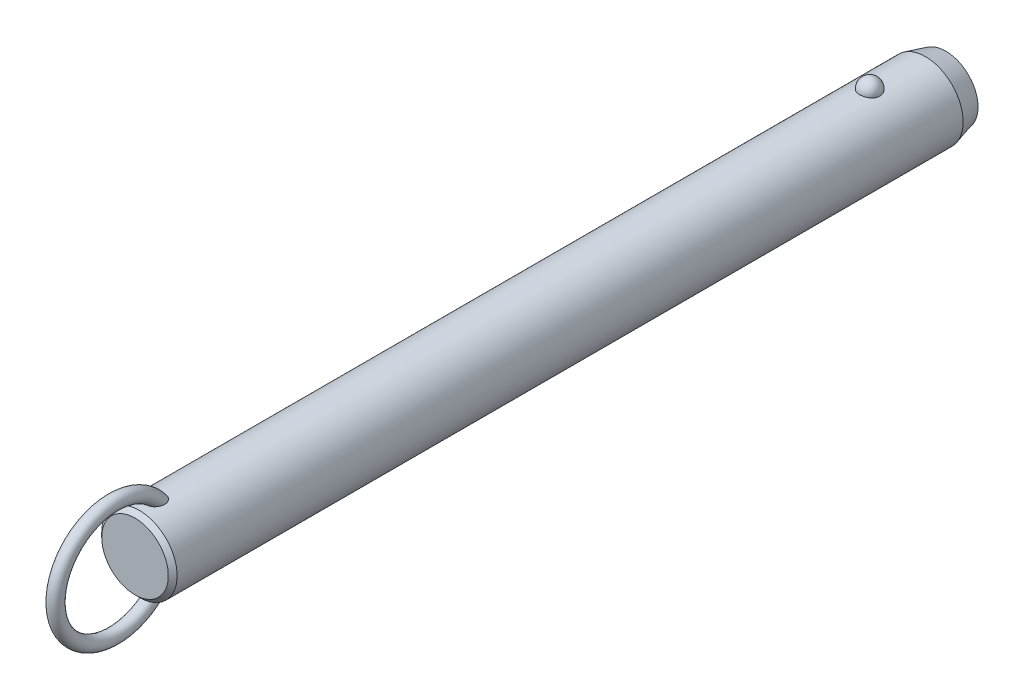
ISO-10303-21;
HEADER;
FILE_DESCRIPTION(('STEP AP214'),'2;1');
FILE_NAME('part.step','',(''),(''),'','','');
FILE_SCHEMA(('AUTOMOTIVE_DESIGN { 1 0 10303 214 1 1 1 1 }'));
ENDSEC;
DATA;
#1=APPLICATION_CONTEXT('core data for automotive mechanical design processes');
#2=APPLICATION_PROTOCOL_DEFINITION('international standard','automotive_design',2000,#1);
#3=PRODUCT_CONTEXT('',#1,'mechanical');
#4=PRODUCT('Part','Part','',(#3));
#5=PRODUCT_RELATED_PRODUCT_CATEGORY('part','',(#4));
#6=PRODUCT_DEFINITION_FORMATION('','',#4);
#7=PRODUCT_DEFINITION_CONTEXT('part definition',#1,'design');
#8=PRODUCT_DEFINITION('design','',#6,#7);
#9=PRODUCT_DEFINITION_SHAPE('','',#8);
#10=(LENGTH_UNIT() NAMED_UNIT(*) SI_UNIT(.MILLI.,.METRE.));
#11=(NAMED_UNIT(*) PLANE_ANGLE_UNIT() SI_UNIT($,.RADIAN.));
#12=(NAMED_UNIT(*) SI_UNIT($,.STERADIAN.) SOLID_ANGLE_UNIT());
#13=UNCERTAINTY_MEASURE_WITH_UNIT(LENGTH_MEASURE(1.E-05),#10,'distance_accuracy_value','');
#14=(GEOMETRIC_REPRESENTATION_CONTEXT(3) GLOBAL_UNCERTAINTY_ASSIGNED_CONTEXT((#13)) GLOBAL_UNIT_ASSIGNED_CONTEXT((#10,
#11,#12)) REPRESENTATION_CONTEXT('',''));
#15=CARTESIAN_POINT('',(0.,0.,0.));
#16=DIRECTION('',(0.,0.,1.));
#17=DIRECTION('',(1.,0.,0.));
#18=AXIS2_PLACEMENT_3D('',#15,#16,#17);
#19=CARTESIAN_POINT('',(0.,0.,200.6));
#20=DIRECTION('',(0.,0.,-1.));
#21=DIRECTION('',(-1.,0.,0.));
#22=AXIS2_PLACEMENT_3D('',#19,#20,#21);
#23=CYLINDRICAL_SURFACE('',#22,11.1);
#24=CARTESIAN_POINT('',(2.9724815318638,10.6945945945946,-3.00000000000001));
#25=CARTESIAN_POINT('',(2.97247830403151,10.6945972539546,-2.8322505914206));
#26=CARTESIAN_POINT('',(2.95876598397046,10.6984356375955,-2.66445972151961));
#27=CARTESIAN_POINT('',(2.90424529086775,10.7133624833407,-2.3336238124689));
#28=CARTESIAN_POINT('',(2.8634252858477,10.7244540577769,-2.17058084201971));
#29=CARTESIAN_POINT('',(2.75573657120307,10.7526272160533,-1.85396767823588));
#30=CARTESIAN_POINT('',(2.68887937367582,10.7697061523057,-1.70039333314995));
#31=CARTESIAN_POINT('',(2.53079696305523,10.8079438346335,-1.4069159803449));
#32=CARTESIAN_POINT('',(2.43957264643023,10.8291024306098,-1.26701246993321));
#33=CARTESIAN_POINT('',(2.23458150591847,10.8732541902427,-1.00409565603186));
#34=CARTESIAN_POINT('',(2.12071295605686,10.8962553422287,-0.881162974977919));
#35=CARTESIAN_POINT('',(1.87365402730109,10.9414421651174,-0.656352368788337));
#36=CARTESIAN_POINT('',(1.74046358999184,10.9636278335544,-0.554474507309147));
#37=CARTESIAN_POINT('',(1.45872188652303,11.0046495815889,-0.374872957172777));
#38=CARTESIAN_POINT('',(1.31021276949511,11.0234944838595,-0.297085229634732));
#39=CARTESIAN_POINT('',(1.00170030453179,11.0557957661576,-0.167529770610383));
#40=CARTESIAN_POINT('',(0.841698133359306,11.0692526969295,-0.1157593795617));
#41=CARTESIAN_POINT('',(0.517607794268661,11.0890932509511,-0.0403925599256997));
#42=CARTESIAN_POINT('',(0.353633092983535,11.0955916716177,-0.0163383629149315));
#43=CARTESIAN_POINT('',(0.0238420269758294,11.1011989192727,0.00445177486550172));
#44=CARTESIAN_POINT('',(-0.141974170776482,11.1003084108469,0.00119017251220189));
#45=CARTESIAN_POINT('',(-0.468405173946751,11.0912990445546,-0.0323233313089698));
#46=CARTESIAN_POINT('',(-0.629059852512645,11.0832767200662,-0.062214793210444));
#47=CARTESIAN_POINT('',(-0.942937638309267,11.0609962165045,-0.147645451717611));
#48=CARTESIAN_POINT('',(-1.09616062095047,11.0467379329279,-0.203185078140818));
#49=CARTESIAN_POINT('',(-1.39181061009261,11.0134071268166,-0.338752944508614));
#50=CARTESIAN_POINT('',(-1.53417383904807,10.9943086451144,-0.418913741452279));
#51=CARTESIAN_POINT('',(-1.80342160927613,10.9533667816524,-0.601448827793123));
#52=CARTESIAN_POINT('',(-1.9303046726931,10.9315231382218,-0.703825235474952));
#53=CARTESIAN_POINT('',(-2.16747598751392,10.887005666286,-0.930091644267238));
#54=CARTESIAN_POINT('',(-2.27742774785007,10.8643239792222,-1.05433291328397));
#55=CARTESIAN_POINT('',(-2.47517316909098,10.8209886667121,-1.31966633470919));
#56=CARTESIAN_POINT('',(-2.56296538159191,10.8003351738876,-1.46075958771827));
#57=CARTESIAN_POINT('',(-2.71500300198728,10.7631304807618,-1.75753646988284));
#58=CARTESIAN_POINT('',(-2.77898901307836,10.7466250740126,-1.91335887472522));
#59=CARTESIAN_POINT('',(-2.88046189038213,10.7198747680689,-2.23391529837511));
#60=CARTESIAN_POINT('',(-2.91794947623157,10.709629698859,-2.3986490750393));
#61=CARTESIAN_POINT('',(-2.96537819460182,10.6965949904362,-2.73165170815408));
#62=CARTESIAN_POINT('',(-2.97542891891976,10.693775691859,-2.89990378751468));
#63=CARTESIAN_POINT('',(-2.96804271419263,10.6958279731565,-3.23575286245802));
#64=CARTESIAN_POINT('',(-2.95060646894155,10.7006993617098,-3.4033498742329));
#65=CARTESIAN_POINT('',(-2.88883358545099,10.71753912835,-3.73233906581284));
#66=CARTESIAN_POINT('',(-2.84462026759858,10.7294749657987,-3.89375610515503));
#67=CARTESIAN_POINT('',(-2.73050447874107,10.7590797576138,-4.20667949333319));
#68=CARTESIAN_POINT('',(-2.66060103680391,10.7767489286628,-4.35818546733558));
#69=CARTESIAN_POINT('',(-2.49642559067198,10.8159599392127,-4.64785421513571));
#70=CARTESIAN_POINT('',(-2.40203047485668,10.8375211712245,-4.78594458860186));
#71=CARTESIAN_POINT('',(-2.19143488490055,10.8820570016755,-5.04410382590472));
#72=CARTESIAN_POINT('',(-2.07523364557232,10.9050316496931,-5.16417205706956));
#73=CARTESIAN_POINT('',(-1.82361254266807,10.9499219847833,-5.3833483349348));
#74=CARTESIAN_POINT('',(-1.68812945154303,10.9718338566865,-5.48238464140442));
#75=CARTESIAN_POINT('',(-1.40191298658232,11.0120611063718,-5.65618873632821));
#76=CARTESIAN_POINT('',(-1.25118062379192,11.0303767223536,-5.73095813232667));
#77=CARTESIAN_POINT('',(-0.940570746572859,11.0611653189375,-5.85334725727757));
#78=CARTESIAN_POINT('',(-0.780821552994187,11.0737044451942,-5.90127578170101));
#79=CARTESIAN_POINT('',(-0.455204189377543,11.0918598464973,-5.96992976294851));
#80=CARTESIAN_POINT('',(-0.289336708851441,11.0974768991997,-5.99065827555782));
#81=CARTESIAN_POINT('',(0.0406846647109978,11.1011307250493,-6.00418773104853));
#82=CARTESIAN_POINT('',(0.204817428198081,11.099299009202,-5.9974731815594));
#83=CARTESIAN_POINT('',(0.5295530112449,11.088551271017,-5.95740317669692));
#84=CARTESIAN_POINT('',(0.69015594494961,11.0796354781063,-5.92404858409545));
#85=CARTESIAN_POINT('',(1.0027760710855,11.0557204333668,-5.83180084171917));
#86=CARTESIAN_POINT('',(1.15482001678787,11.0407414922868,-5.7729929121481));
#87=CARTESIAN_POINT('',(1.44678373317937,11.0062913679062,-5.63147366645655));
#88=CARTESIAN_POINT('',(1.58670279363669,10.9868199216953,-5.54876095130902));
#89=CARTESIAN_POINT('',(1.8527023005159,10.9451315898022,-5.36027644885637));
#90=CARTESIAN_POINT('',(1.97855158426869,10.9228788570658,-5.25418644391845));
#91=CARTESIAN_POINT('',(2.21080872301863,10.8782509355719,-5.02251354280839));
#92=CARTESIAN_POINT('',(2.31721312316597,10.8558757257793,-4.89692718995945));
#93=CARTESIAN_POINT('',(2.5094551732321,10.8130715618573,-4.62745408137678));
#94=CARTESIAN_POINT('',(2.59493284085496,10.7926798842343,-4.48330448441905));
#95=CARTESIAN_POINT('',(2.740862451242,10.7565495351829,-4.18236358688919));
#96=CARTESIAN_POINT('',(2.80132490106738,10.7408089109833,-4.02557762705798));
#97=CARTESIAN_POINT('',(2.88959070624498,10.7173718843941,-3.72475308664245));
#98=CARTESIAN_POINT('',(2.92062102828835,10.7088950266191,-3.58171216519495));
#99=CARTESIAN_POINT('',(2.96206765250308,10.6975052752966,-3.29245795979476));
#100=CARTESIAN_POINT('',(2.97248434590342,10.6945922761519,-3.14624473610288));
#101=CARTESIAN_POINT('',(2.9724815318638,10.6945945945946,-3.00000000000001));
#102=B_SPLINE_CURVE_WITH_KNOTS('',3,(#24,#25,#26,#27,#28,#29,#30,#31,#32,#33,#34,#35,#36,#37,
#38,#39,#40,#41,#42,#43,#44,#45,#46,#47,#48,#49,#50,#51,#52,#53,#54,#55,#56,#57,#58,#59,#60,#61,
#62,#63,#64,#65,#66,#67,#68,#69,#70,#71,#72,#73,#74,#75,#76,#77,#78,#79,#80,#81,#82,#83,#84,#85,
#86,#87,#88,#89,#90,#91,#92,#93,#94,#95,#96,#97,#98,#99,#100,#101),.UNSPECIFIED.,.T.,.F.,(4,2,2,
2,2,2,2,2,2,2,2,2,2,2,2,2,2,2,2,2,2,2,2,2,2,2,2,2,2,2,2,2,2,2,2,2,2,2,4),(0.,0.502722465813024,
1.00566079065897,1.5083769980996,2.01107471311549,2.51608392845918,3.02109467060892,
3.52475118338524,4.02835620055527,4.523518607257,5.0186364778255,5.50715297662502,
5.9956776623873,6.48688002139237,6.97812923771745,7.47814366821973,7.9781907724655,
8.48353712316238,8.9888697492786,9.49218093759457,9.99547960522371,10.4964777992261,
10.997494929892,11.5010810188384,12.0046847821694,12.5099796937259,13.0152411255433,
13.5145635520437,14.0138298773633,14.5043200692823,14.9947943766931,15.4836390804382,
15.9725123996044,16.4685040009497,16.9645836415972,17.4686765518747,17.972557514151,
18.410841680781,18.849117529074),.UNSPECIFIED.);
#103=CARTESIAN_POINT('',(2.9724815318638,10.6945945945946,-3.00000000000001));
#104=VERTEX_POINT('',#103);
#105=EDGE_CURVE('E41',#104,#104,#102,.T.);
#106=ORIENTED_EDGE('',*,*,#105,.T.);
#107=EDGE_LOOP('',(#106));
#108=FACE_BOUND('',#107,.T.);
#109=CARTESIAN_POINT('',(0.,0.,212.));
#110=DIRECTION('',(0.,0.,1.));
#111=DIRECTION('',(1.,0.,0.));
#112=AXIS2_PLACEMENT_3D('',#109,#110,#111);
#113=CIRCLE('',#112,11.1);
#114=CARTESIAN_POINT('',(-11.1,0.,212.));
#115=VERTEX_POINT('',#114);
#116=EDGE_CURVE('E10',#115,#115,#113,.F.);
#117=ORIENTED_EDGE('',*,*,#116,.T.);
#118=EDGE_LOOP('',(#117));
#119=FACE_BOUND('',#118,.T.);
#120=CARTESIAN_POINT('',(-0.564520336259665,-11.0856356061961,204.257815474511));
#121=CARTESIAN_POINT('',(-0.667202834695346,-11.0804062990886,204.291283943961));
#122=CARTESIAN_POINT('',(-0.766875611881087,-11.0738877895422,204.333835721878));
#123=CARTESIAN_POINT('',(-0.95728412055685,-11.0590576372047,204.435419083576));
#124=CARTESIAN_POINT('',(-1.04801616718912,-11.0507452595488,204.49445742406));
#125=CARTESIAN_POINT('',(-1.21800952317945,-11.0333016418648,204.626529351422));
#126=CARTESIAN_POINT('',(-1.2973080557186,-11.0241732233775,204.699515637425));
#127=CARTESIAN_POINT('',(-1.44337665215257,-11.0060026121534,204.857037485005));
#128=CARTESIAN_POINT('',(-1.51014622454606,-10.9969604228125,204.941573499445));
#129=CARTESIAN_POINT('',(-1.63454620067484,-10.9791841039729,205.125521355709));
#130=CARTESIAN_POINT('',(-1.69127003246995,-10.9705107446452,205.225549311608));
#131=CARTESIAN_POINT('',(-1.7898078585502,-10.9548648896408,205.432790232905));
#132=CARTESIAN_POINT('',(-1.83161214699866,-10.9478935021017,205.540007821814));
#133=CARTESIAN_POINT('',(-1.91557028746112,-10.9335803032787,205.805408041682));
#134=CARTESIAN_POINT('',(-1.95040620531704,-10.9273269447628,205.965980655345));
#135=CARTESIAN_POINT('',(-1.99388326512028,-10.9194709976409,206.290697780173));
#136=CARTESIAN_POINT('',(-2.00248051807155,-10.9178762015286,206.454847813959));
#137=CARTESIAN_POINT('',(-1.99551615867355,-10.9191578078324,206.824650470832));
#138=CARTESIAN_POINT('',(-1.9732206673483,-10.9232807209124,207.030191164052));
#139=CARTESIAN_POINT('',(-1.9152976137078,-10.9335244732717,207.333595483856));
#140=CARTESIAN_POINT('',(-1.89184575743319,-10.9376266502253,207.434088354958));
#141=CARTESIAN_POINT('',(-1.83700674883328,-10.9469720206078,207.632855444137));
#142=CARTESIAN_POINT('',(-1.80562070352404,-10.9522150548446,207.731129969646));
#143=CARTESIAN_POINT('',(-1.73463055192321,-10.9636837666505,207.925914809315));
#144=CARTESIAN_POINT('',(-1.69493416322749,-10.9699202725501,208.022390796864));
#145=CARTESIAN_POINT('',(-1.60745141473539,-10.9830806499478,208.211626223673));
#146=CARTESIAN_POINT('',(-1.55966150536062,-10.9900048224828,208.304384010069));
#147=CARTESIAN_POINT('',(-1.45591812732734,-11.0042280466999,208.484690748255));
#148=CARTESIAN_POINT('',(-1.40000013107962,-11.0115253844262,208.572260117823));
#149=CARTESIAN_POINT('',(-1.27937470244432,-11.0261911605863,208.741029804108));
#150=CARTESIAN_POINT('',(-1.21467835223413,-11.0335594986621,208.82223795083));
#151=CARTESIAN_POINT('',(-1.08218150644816,-11.0473027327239,208.969001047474));
#152=CARTESIAN_POINT('',(-1.01522633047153,-11.0537063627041,209.035309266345));
#153=CARTESIAN_POINT('',(-0.872952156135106,-11.065850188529,209.158378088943));
#154=CARTESIAN_POINT('',(-0.797642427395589,-11.0715911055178,209.215149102));
#155=CARTESIAN_POINT('',(-0.651396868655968,-11.081071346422,209.307515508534));
#156=CARTESIAN_POINT('',(-0.581712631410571,-11.0849841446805,209.345049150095));
#157=CARTESIAN_POINT('',(-0.43706608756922,-11.0916271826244,209.408259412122));
#158=CARTESIAN_POINT('',(-0.362109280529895,-11.0943586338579,209.433948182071));
#159=CARTESIAN_POINT('',(-0.207828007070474,-11.0983242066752,209.471117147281));
#160=CARTESIAN_POINT('',(-0.12846771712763,-11.0995432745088,209.482454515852));
#161=CARTESIAN_POINT('',(0.0309101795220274,-11.1002423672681,209.488965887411));
#162=CARTESIAN_POINT('',(0.110927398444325,-11.0997233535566,209.484148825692));
#163=CARTESIAN_POINT('',(0.25640659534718,-11.097240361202,209.460959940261));
#164=CARTESIAN_POINT('',(0.322235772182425,-11.0955074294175,209.444754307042));
#165=CARTESIAN_POINT('',(0.450635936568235,-11.0910350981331,209.402600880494));
#166=CARTESIAN_POINT('',(0.513205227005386,-11.0882951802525,209.376648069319));
#167=CARTESIAN_POINT('',(0.662626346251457,-11.0805620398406,209.302607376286));
#168=CARTESIAN_POINT('',(0.747127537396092,-11.0751144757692,209.249845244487));
#169=CARTESIAN_POINT('',(0.906756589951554,-11.0631932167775,209.131720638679));
#170=CARTESIAN_POINT('',(0.981859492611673,-11.0567168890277,209.066325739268));
#171=CARTESIAN_POINT('',(1.10712207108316,-11.0447856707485,208.94226337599));
#172=CARTESIAN_POINT('',(1.15909566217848,-11.0394280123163,208.885383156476));
#173=CARTESIAN_POINT('',(1.25791923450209,-11.0286040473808,208.767327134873));
#174=CARTESIAN_POINT('',(1.30476642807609,-11.0231376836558,208.706149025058));
#175=CARTESIAN_POINT('',(1.43818612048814,-11.0068027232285,208.517305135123));
#176=CARTESIAN_POINT('',(1.51751767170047,-10.9960104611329,208.384453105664));
#177=CARTESIAN_POINT('',(1.63597546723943,-10.9788847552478,208.153137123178));
#178=CARTESIAN_POINT('',(1.67988876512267,-10.9722190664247,208.057053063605));
#179=CARTESIAN_POINT('',(1.75953241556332,-10.9597298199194,207.861431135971));
#180=CARTESIAN_POINT('',(1.7952596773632,-10.9539065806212,207.761891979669));
#181=CARTESIAN_POINT('',(1.85844731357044,-10.9433632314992,207.56021118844));
#182=CARTESIAN_POINT('',(1.88591073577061,-10.9386427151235,207.45807052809));
#183=CARTESIAN_POINT('',(1.93234324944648,-10.9305350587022,207.251819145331));
#184=CARTESIAN_POINT('',(1.95131065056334,-10.9271481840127,207.147708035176));
#185=CARTESIAN_POINT('',(1.9904020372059,-10.9201183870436,206.865458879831));
#186=CARTESIAN_POINT('',(2.00221217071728,-10.9179256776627,206.686037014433));
#187=CARTESIAN_POINT('',(1.99711676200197,-10.9188636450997,206.327713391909));
#188=CARTESIAN_POINT('',(1.98026150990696,-10.9219849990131,206.148811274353));
#189=CARTESIAN_POINT('',(1.92151657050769,-10.9324473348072,205.83645144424));
#190=CARTESIAN_POINT('',(1.88605081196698,-10.9386915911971,205.701759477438));
#191=CARTESIAN_POINT('',(1.79393020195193,-10.9541780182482,205.439966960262));
#192=CARTESIAN_POINT('',(1.73729868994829,-10.9634168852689,205.312858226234));
#193=CARTESIAN_POINT('',(1.61237037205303,-10.9824218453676,205.089418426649));
#194=CARTESIAN_POINT('',(1.54715374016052,-10.9918945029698,204.991345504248));
#195=CARTESIAN_POINT('',(1.40127026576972,-11.0114415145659,204.807434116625));
#196=CARTESIAN_POINT('',(1.32060742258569,-11.0215157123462,204.721592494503));
#197=CARTESIAN_POINT('',(1.1447478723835,-11.041168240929,204.565163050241));
#198=CARTESIAN_POINT('',(1.04947805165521,-11.0507437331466,204.494656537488));
#199=CARTESIAN_POINT('',(0.847278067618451,-11.0680789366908,204.372640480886));
#200=CARTESIAN_POINT('',(0.74035174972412,-11.0758392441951,204.321124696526));
#201=CARTESIAN_POINT('',(0.529289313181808,-11.0878275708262,204.243485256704));
#202=CARTESIAN_POINT('',(0.425895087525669,-11.0923259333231,204.215377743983));
#203=CARTESIAN_POINT('',(0.215723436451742,-11.0984001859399,204.177703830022));
#204=CARTESIAN_POINT('',(0.108947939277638,-11.0999777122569,204.168127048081));
#205=CARTESIAN_POINT('',(-0.0938962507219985,-11.1000196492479,204.167877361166));
#206=CARTESIAN_POINT('',(-0.189967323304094,-11.0987797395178,204.175408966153));
#207=CARTESIAN_POINT('',(-0.379657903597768,-11.0939111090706,204.205507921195));
#208=CARTESIAN_POINT('',(-0.47327735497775,-11.0902823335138,204.228075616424));
#209=CARTESIAN_POINT('',(-0.564520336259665,-11.0856356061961,204.257815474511));
#210=B_SPLINE_CURVE_WITH_KNOTS('',3,(#120,#121,#122,#123,#124,#125,#126,#127,#128,#129,#130,
#131,#132,#133,#134,#135,#136,#137,#138,#139,#140,#141,#142,#143,#144,#145,#146,#147,#148,#149,
#150,#151,#152,#153,#154,#155,#156,#157,#158,#159,#160,#161,#162,#163,#164,#165,#166,#167,#168,
#169,#170,#171,#172,#173,#174,#175,#176,#177,#178,#179,#180,#181,#182,#183,#184,#185,#186,#187,
#188,#189,#190,#191,#192,#193,#194,#195,#196,#197,#198,#199,#200,#201,#202,#203,#204,#205,#206,
#207,#208,#209),.UNSPECIFIED.,.T.,.F.,(4,2,2,2,2,2,2,2,2,2,2,2,2,2,2,2,2,2,2,2,2,2,2,2,2,2,2,2,
2,2,2,2,2,2,2,2,2,2,2,2,2,2,2,2,4),(0.,0.323999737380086,0.64813245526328,0.971184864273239,
1.29424994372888,1.63886237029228,1.98369857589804,2.47426059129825,2.96564271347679,
3.58257396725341,3.89215258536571,4.20168803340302,4.51486273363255,4.82817514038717,
5.14015911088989,5.45175282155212,5.73442856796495,6.01679375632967,6.2536458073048,
6.49025437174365,6.72919963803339,6.96801276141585,7.17061258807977,7.37331685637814,
7.67094989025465,7.96935728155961,8.2007506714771,8.43226927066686,8.89581623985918,
9.21306533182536,9.53043400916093,9.84768549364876,10.1650000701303,10.7022930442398,
11.2386443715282,11.655339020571,12.071575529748,12.4245637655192,12.7774607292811,
13.1321855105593,13.4867936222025,13.8068771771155,14.1267813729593,14.4146787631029,
14.7025827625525),.UNSPECIFIED.);
#211=CARTESIAN_POINT('',(-0.564520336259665,-11.0856356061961,204.257815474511));
#212=VERTEX_POINT('',#211);
#213=EDGE_CURVE('E59',#212,#212,#210,.T.);
#214=ORIENTED_EDGE('',*,*,#213,.T.);
#215=EDGE_LOOP('',(#214));
#216=FACE_BOUND('',#215,.T.);
#217=CARTESIAN_POINT('',(-0.564520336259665,11.0856356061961,204.257815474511));
#218=CARTESIAN_POINT('',(-0.468542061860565,11.0905203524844,204.226545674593));
#219=CARTESIAN_POINT('',(-0.369793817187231,11.0942886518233,204.203157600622));
#220=CARTESIAN_POINT('',(-0.169555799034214,11.0991586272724,204.173085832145));
#221=CARTESIAN_POINT('',(-0.0680604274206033,11.1002543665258,204.16643932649));
#222=CARTESIAN_POINT('',(0.134549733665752,11.099646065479,204.170157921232));
#223=CARTESIAN_POINT('',(0.235664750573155,11.0979441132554,204.18051033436));
#224=CARTESIAN_POINT('',(0.434632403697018,11.0919342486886,204.217831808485));
#225=CARTESIAN_POINT('',(0.532486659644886,11.0876276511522,204.244792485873));
#226=CARTESIAN_POINT('',(0.722445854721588,11.0768742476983,204.3144096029));
#227=CARTESIAN_POINT('',(0.814543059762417,11.0704246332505,204.357086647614));
#228=CARTESIAN_POINT('',(0.990565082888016,11.0560659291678,204.456648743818));
#229=CARTESIAN_POINT('',(1.07448844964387,11.048156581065,204.513536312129));
#230=CARTESIAN_POINT('',(1.23562672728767,11.0313221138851,204.642210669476));
#231=CARTESIAN_POINT('',(1.3124268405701,11.0223686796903,204.714511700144));
#232=CARTESIAN_POINT('',(1.45398030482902,11.0045918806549,204.870042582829));
#233=CARTESIAN_POINT('',(1.51873073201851,10.9957685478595,204.953275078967));
#234=CARTESIAN_POINT('',(1.64107232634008,10.9782087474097,205.136384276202));
#235=CARTESIAN_POINT('',(1.6974317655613,10.9695572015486,205.237089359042));
#236=CARTESIAN_POINT('',(1.79515063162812,10.9539887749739,205.445626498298));
#237=CARTESIAN_POINT('',(1.83649966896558,10.9470730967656,205.55346343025));
#238=CARTESIAN_POINT('',(1.91931148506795,10.9329211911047,205.820399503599));
#239=CARTESIAN_POINT('',(1.95340104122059,10.9267904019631,205.981861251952));
#240=CARTESIAN_POINT('',(1.99526195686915,10.9192174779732,206.30821631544));
#241=CARTESIAN_POINT('',(2.00298989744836,10.9177830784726,206.47311484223));
#242=CARTESIAN_POINT('',(1.99396251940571,10.9194420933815,206.844100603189));
#243=CARTESIAN_POINT('',(1.97050829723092,10.923774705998,207.05003871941));
#244=CARTESIAN_POINT('',(1.91079643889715,10.9343131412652,207.353901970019));
#245=CARTESIAN_POINT('',(1.88673702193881,10.9385106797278,207.454529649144));
#246=CARTESIAN_POINT('',(1.8306550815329,10.9480376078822,207.653510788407));
#247=CARTESIAN_POINT('',(1.79863369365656,10.9533668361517,207.751864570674));
#248=CARTESIAN_POINT('',(1.72633365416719,10.9649954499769,207.946720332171));
#249=CARTESIAN_POINT('',(1.68596409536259,10.9713053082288,208.04318790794));
#250=CARTESIAN_POINT('',(1.59707998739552,10.9845964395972,208.232323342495));
#251=CARTESIAN_POINT('',(1.54856169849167,10.9915780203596,208.324989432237));
#252=CARTESIAN_POINT('',(1.44330168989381,11.0058935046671,208.504975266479));
#253=CARTESIAN_POINT('',(1.3865974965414,11.0132257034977,208.592316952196));
#254=CARTESIAN_POINT('',(1.26431158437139,11.0279330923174,208.760456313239));
#255=CARTESIAN_POINT('',(1.19874160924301,11.0353082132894,208.841262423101));
#256=CARTESIAN_POINT('',(1.06542088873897,11.048931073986,208.985985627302));
#257=CARTESIAN_POINT('',(0.998640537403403,11.0552153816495,209.050784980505));
#258=CARTESIAN_POINT('',(0.856896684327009,11.0671032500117,209.170846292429));
#259=CARTESIAN_POINT('',(0.781942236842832,11.0727075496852,209.226118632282));
#260=CARTESIAN_POINT('',(0.636276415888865,11.081949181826,209.315972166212));
#261=CARTESIAN_POINT('',(0.566755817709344,11.0857572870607,209.352441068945));
#262=CARTESIAN_POINT('',(0.422602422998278,11.0921860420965,209.413533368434));
#263=CARTESIAN_POINT('',(0.347974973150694,11.0948079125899,209.438168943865));
#264=CARTESIAN_POINT('',(0.194593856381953,11.0985608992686,209.473323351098));
#265=CARTESIAN_POINT('',(0.115807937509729,11.0996777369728,209.483706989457));
#266=CARTESIAN_POINT('',(-0.0422499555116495,11.1002003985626,209.488574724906));
#267=CARTESIAN_POINT('',(-0.121521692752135,11.09960699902,209.483066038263));
#268=CARTESIAN_POINT('',(-0.266046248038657,11.0970123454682,209.458827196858));
#269=CARTESIAN_POINT('',(-0.331661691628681,11.0952283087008,209.442135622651));
#270=CARTESIAN_POINT('',(-0.459588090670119,11.0906663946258,209.399111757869));
#271=CARTESIAN_POINT('',(-0.52189737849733,11.0878880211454,209.372774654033));
#272=CARTESIAN_POINT('',(-0.671446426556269,11.0800342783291,209.297513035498));
#273=CARTESIAN_POINT('',(-0.756250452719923,11.0744969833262,209.243818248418));
#274=CARTESIAN_POINT('',(-0.916349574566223,11.0624045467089,209.123802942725));
#275=CARTESIAN_POINT('',(-0.991618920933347,11.0558467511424,209.057449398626));
#276=CARTESIAN_POINT('',(-1.11713140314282,11.0437783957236,208.931633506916));
#277=CARTESIAN_POINT('',(-1.1692053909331,11.0383619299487,208.873952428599));
#278=CARTESIAN_POINT('',(-1.26817476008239,11.02743010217,208.754280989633));
#279=CARTESIAN_POINT('',(-1.31506731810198,11.0219146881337,208.692288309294));
#280=CARTESIAN_POINT('',(-1.40399813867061,11.0109399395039,208.564784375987));
#281=CARTESIAN_POINT('',(-1.44602864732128,11.0054807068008,208.499267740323));
#282=CARTESIAN_POINT('',(-1.52538779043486,10.9947621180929,208.365422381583));
#283=CARTESIAN_POINT('',(-1.56271516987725,10.9895028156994,208.297092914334));
#284=CARTESIAN_POINT('',(-1.64537943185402,10.9774790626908,208.133210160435));
#285=CARTESIAN_POINT('',(-1.68879497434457,10.9708503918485,208.0366735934));
#286=CARTESIAN_POINT('',(-1.76740738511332,10.9584602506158,207.840236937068));
#287=CARTESIAN_POINT('',(-1.80260120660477,10.95269910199,207.74033561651));
#288=CARTESIAN_POINT('',(-1.86468657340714,10.9423003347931,207.537966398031));
#289=CARTESIAN_POINT('',(-1.8915816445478,10.9376622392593,207.435499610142));
#290=CARTESIAN_POINT('',(-1.93682458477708,10.9297405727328,207.228642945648));
#291=CARTESIAN_POINT('',(-1.95517082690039,10.9264572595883,207.124252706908));
#292=CARTESIAN_POINT('',(-1.99232562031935,10.9197647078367,206.84262876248));
#293=CARTESIAN_POINT('',(-2.00294603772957,10.9177914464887,206.664185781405));
#294=CARTESIAN_POINT('',(-1.99566675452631,10.9191290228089,206.307996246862));
#295=CARTESIAN_POINT('',(-1.97781651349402,10.9224306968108,206.13024902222));
#296=CARTESIAN_POINT('',(-1.91747214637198,10.9331592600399,205.819792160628));
#297=CARTESIAN_POINT('',(-1.88131022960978,10.9395108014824,205.685825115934));
#298=CARTESIAN_POINT('',(-1.78790380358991,10.9551659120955,205.42559757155));
#299=CARTESIAN_POINT('',(-1.73068309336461,10.9644661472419,205.299328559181));
#300=CARTESIAN_POINT('',(-1.60475573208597,10.9835398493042,205.07741565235));
#301=CARTESIAN_POINT('',(-1.53908879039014,10.9930297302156,204.980026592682));
#302=CARTESIAN_POINT('',(-1.39238608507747,11.0125708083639,204.797525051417));
#303=CARTESIAN_POINT('',(-1.31135150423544,11.0226219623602,204.712411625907));
#304=CARTESIAN_POINT('',(-1.14382035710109,11.0411991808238,204.56529943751));
#305=CARTESIAN_POINT('',(-1.0585850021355,11.0497792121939,204.50186930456));
#306=CARTESIAN_POINT('',(-0.878723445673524,11.0655285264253,204.390250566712));
#307=CARTESIAN_POINT('',(-0.784123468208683,11.0727015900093,204.342020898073));
#308=CARTESIAN_POINT('',(-0.646163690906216,11.0812501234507,204.286023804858));
#309=CARTESIAN_POINT('',(-0.605595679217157,11.0835451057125,204.271197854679));
#310=CARTESIAN_POINT('',(-0.564520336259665,11.0856356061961,204.257815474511));
#311=B_SPLINE_CURVE_WITH_KNOTS('',3,(#217,#218,#219,#220,#221,#222,#223,#224,#225,#226,#227,
#228,#229,#230,#231,#232,#233,#234,#235,#236,#237,#238,#239,#240,#241,#242,#243,#244,#245,#246,
#247,#248,#249,#250,#251,#252,#253,#254,#255,#256,#257,#258,#259,#260,#261,#262,#263,#264,#265,
#266,#267,#268,#269,#270,#271,#272,#273,#274,#275,#276,#277,#278,#279,#280,#281,#282,#283,#284,
#285,#286,#287,#288,#289,#290,#291,#292,#293,#294,#295,#296,#297,#298,#299,#300,#301,#302,#303,
#304,#305,#306,#307,#308,#309,#310),.UNSPECIFIED.,.T.,.F.,(4,2,2,2,2,2,2,2,2,2,2,2,2,2,2,2,2,2,
2,2,2,2,2,2,2,2,2,2,2,2,2,2,2,2,2,2,2,2,2,2,2,2,2,2,2,2,4),(0.,0.303061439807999,
0.606795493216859,0.910302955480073,1.21365733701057,1.51741085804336,1.82121821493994,
2.13745205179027,2.45376252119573,2.79958678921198,3.14564996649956,3.63832391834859,
4.13180893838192,4.75031912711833,5.06071926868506,5.37107516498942,5.6850077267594,
5.99908475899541,6.31176519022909,6.62403542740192,6.90315673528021,7.18197194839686,
7.41687778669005,7.65154134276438,7.88841587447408,8.12518286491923,8.32752842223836,
8.52997509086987,8.82986421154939,9.13054668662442,9.36393502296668,9.59744991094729,
9.83133221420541,10.0652767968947,10.383032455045,10.7009056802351,11.0186436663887,
11.3364420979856,11.8705925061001,12.4038159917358,12.8189662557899,13.2336487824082,
13.5857049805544,13.9377340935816,14.2561354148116,14.5736690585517,14.7033687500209),.UNSPECIFIED.);
#312=CARTESIAN_POINT('',(-0.564520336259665,11.0856356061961,204.257815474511));
#313=VERTEX_POINT('',#312);
#314=EDGE_CURVE('E67',#313,#313,#311,.T.);
#315=ORIENTED_EDGE('',*,*,#314,.T.);
#316=EDGE_LOOP('',(#315));
#317=FACE_BOUND('',#316,.T.);
#318=CARTESIAN_POINT('',(0.,0.,-19.4));
#319=DIRECTION('',(0.,0.,-1.));
#320=DIRECTION('',(-1.,0.,0.));
#321=AXIS2_PLACEMENT_3D('',#318,#319,#320);
#322=CIRCLE('',#321,11.1);
#323=CARTESIAN_POINT('',(-11.1,0.,-19.4));
#324=VERTEX_POINT('',#323);
#325=EDGE_CURVE('E56',#324,#324,#322,.F.);
#326=ORIENTED_EDGE('',*,*,#325,.T.);
#327=EDGE_LOOP('',(#326));
#328=FACE_BOUND('',#327,.T.);
#329=ADVANCED_FACE('F37',(#108,#119,#216,#317,#328),#23,.T.);
#330=CARTESIAN_POINT('',(0.,0.,-25.4));
#331=DIRECTION('',(0.,0.,-1.));
#332=DIRECTION('',(-1.,0.,0.));
#333=AXIS2_PLACEMENT_3D('',#330,#331,#332);
#334=PLANE('',#333);
#335=CARTESIAN_POINT('',(0.,0.,-25.4));
#336=DIRECTION('',(0.,0.,-1.));
#337=DIRECTION('',(-1.,0.,0.));
#338=AXIS2_PLACEMENT_3D('',#335,#336,#337);
#339=CIRCLE('',#338,9.49230484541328);
#340=CARTESIAN_POINT('',(-9.49230484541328,0.,-25.4));
#341=VERTEX_POINT('',#340);
#342=EDGE_CURVE('E66',#341,#341,#339,.T.);
#343=ORIENTED_EDGE('',*,*,#342,.T.);
#344=EDGE_LOOP('',(#343));
#345=FACE_BOUND('',#344,.T.);
#346=ADVANCED_FACE('F85',(#345),#334,.T.);
#347=CARTESIAN_POINT('',(0.,0.,-25.4));
#348=DIRECTION('',(0.,0.,1.));
#349=DIRECTION('',(1.,0.,0.));
#350=AXIS2_PLACEMENT_3D('',#347,#348,#349);
#351=CONICAL_SURFACE('',#350,9.49230484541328,0.261799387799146);
#352=ORIENTED_EDGE('',*,*,#325,.F.);
#353=EDGE_LOOP('',(#352));
#354=FACE_BOUND('',#353,.T.);
#355=ORIENTED_EDGE('',*,*,#342,.F.);
#356=EDGE_LOOP('',(#355));
#357=FACE_BOUND('',#356,.T.);
#358=ADVANCED_FACE('F83',(#354,#357),#351,.T.);
#359=CARTESIAN_POINT('',(0.,0.,213.3));
#360=DIRECTION('',(0.,0.,1.));
#361=DIRECTION('',(1.,0.,0.));
#362=AXIS2_PLACEMENT_3D('',#359,#360,#361);
#363=PLANE('',#362);
#364=CARTESIAN_POINT('',(0.,0.,213.3));
#365=DIRECTION('',(0.,0.,1.));
#366=DIRECTION('',(1.,0.,0.));
#367=AXIS2_PLACEMENT_3D('',#364,#365,#366);
#368=CIRCLE('',#367,9.79999999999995);
#369=CARTESIAN_POINT('',(-9.79999999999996,0.,213.3));
#370=VERTEX_POINT('',#369);
#371=EDGE_CURVE('E50',#370,#370,#368,.T.);
#372=ORIENTED_EDGE('',*,*,#371,.T.);
#373=EDGE_LOOP('',(#372));
#374=FACE_BOUND('',#373,.T.);
#375=ADVANCED_FACE('F77',(#374),#363,.T.);
#376=CARTESIAN_POINT('',(0.,0.,219.65));
#377=DIRECTION('',(1.,0.,0.));
#378=DIRECTION('',(0.,0.,-1.));
#379=AXIS2_PLACEMENT_3D('',#376,#377,#378);
#380=TOROIDAL_SURFACE('',#379,17.05,2.);
#381=ORIENTED_EDGE('',*,*,#314,.F.);
#382=EDGE_LOOP('',(#381));
#383=FACE_BOUND('',#382,.T.);
#384=ORIENTED_EDGE('',*,*,#213,.F.);
#385=EDGE_LOOP('',(#384));
#386=FACE_BOUND('',#385,.T.);
#387=ADVANCED_FACE('F73',(#383,#386),#380,.T.);
#388=CARTESIAN_POINT('',(0.,0.,213.3));
#389=DIRECTION('',(0.,0.,-1.));
#390=DIRECTION('',(-1.,0.,0.));
#391=AXIS2_PLACEMENT_3D('',#388,#389,#390);
#392=CONICAL_SURFACE('',#391,9.79999999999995,0.785398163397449);
#393=CARTESIAN_POINT('',(-11.1,0.,212.));
#394=CARTESIAN_POINT('',(-11.0864583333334,0.,212.013541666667));
#395=CARTESIAN_POINT('',(-11.0729166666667,0.,212.027083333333));
#396=CARTESIAN_POINT('',(-11.0458333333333,0.,212.054166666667));
#397=CARTESIAN_POINT('',(-11.0322916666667,0.,212.067708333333));
#398=CARTESIAN_POINT('',(-11.0052083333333,0.,212.094791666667));
#399=CARTESIAN_POINT('',(-10.9916666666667,0.,212.108333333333));
#400=CARTESIAN_POINT('',(-10.9645833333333,0.,212.135416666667));
#401=CARTESIAN_POINT('',(-10.9510416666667,0.,212.148958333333));
#402=CARTESIAN_POINT('',(-10.9239583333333,0.,212.176041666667));
#403=CARTESIAN_POINT('',(-10.9104166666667,0.,212.189583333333));
#404=CARTESIAN_POINT('',(-10.8833333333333,0.,212.216666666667));
#405=CARTESIAN_POINT('',(-10.8697916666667,0.,212.230208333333));
#406=CARTESIAN_POINT('',(-10.8427083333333,0.,212.257291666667));
#407=CARTESIAN_POINT('',(-10.8291666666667,0.,212.270833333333));
#408=CARTESIAN_POINT('',(-10.8020833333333,0.,212.297916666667));
#409=CARTESIAN_POINT('',(-10.7885416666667,0.,212.311458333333));
#410=CARTESIAN_POINT('',(-10.7614583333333,0.,212.338541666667));
#411=CARTESIAN_POINT('',(-10.7479166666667,0.,212.352083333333));
#412=CARTESIAN_POINT('',(-10.7208333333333,0.,212.379166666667));
#413=CARTESIAN_POINT('',(-10.7072916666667,0.,212.392708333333));
#414=CARTESIAN_POINT('',(-10.6802083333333,0.,212.419791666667));
#415=CARTESIAN_POINT('',(-10.6666666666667,0.,212.433333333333));
#416=CARTESIAN_POINT('',(-10.6395833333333,0.,212.460416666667));
#417=CARTESIAN_POINT('',(-10.6260416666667,0.,212.473958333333));
#418=CARTESIAN_POINT('',(-10.5989583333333,0.,212.501041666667));
#419=CARTESIAN_POINT('',(-10.5854166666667,0.,212.514583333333));
#420=CARTESIAN_POINT('',(-10.5583333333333,0.,212.541666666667));
#421=CARTESIAN_POINT('',(-10.5447916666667,0.,212.555208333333));
#422=CARTESIAN_POINT('',(-10.5177083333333,0.,212.582291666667));
#423=CARTESIAN_POINT('',(-10.5041666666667,0.,212.595833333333));
#424=CARTESIAN_POINT('',(-10.4770833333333,0.,212.622916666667));
#425=CARTESIAN_POINT('',(-10.4635416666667,0.,212.636458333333));
#426=CARTESIAN_POINT('',(-10.4364583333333,0.,212.663541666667));
#427=CARTESIAN_POINT('',(-10.4229166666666,0.,212.677083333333));
#428=CARTESIAN_POINT('',(-10.3958333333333,0.,212.704166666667));
#429=CARTESIAN_POINT('',(-10.3822916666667,0.,212.717708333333));
#430=CARTESIAN_POINT('',(-10.3552083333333,0.,212.744791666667));
#431=CARTESIAN_POINT('',(-10.3416666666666,0.,212.758333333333));
#432=CARTESIAN_POINT('',(-10.3145833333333,0.,212.785416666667));
#433=CARTESIAN_POINT('',(-10.3010416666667,0.,212.798958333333));
#434=CARTESIAN_POINT('',(-10.2739583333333,0.,212.826041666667));
#435=CARTESIAN_POINT('',(-10.2604166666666,0.,212.839583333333));
#436=CARTESIAN_POINT('',(-10.2333333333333,0.,212.866666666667));
#437=CARTESIAN_POINT('',(-10.2197916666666,0.,212.880208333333));
#438=CARTESIAN_POINT('',(-10.1927083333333,0.,212.907291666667));
#439=CARTESIAN_POINT('',(-10.1791666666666,0.,212.920833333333));
#440=CARTESIAN_POINT('',(-10.1520833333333,0.,212.947916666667));
#441=CARTESIAN_POINT('',(-10.1385416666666,0.,212.961458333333));
#442=CARTESIAN_POINT('',(-10.1114583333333,0.,212.988541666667));
#443=CARTESIAN_POINT('',(-10.0979166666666,0.,213.002083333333));
#444=CARTESIAN_POINT('',(-10.0708333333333,0.,213.029166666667));
#445=CARTESIAN_POINT('',(-10.0572916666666,0.,213.042708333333));
#446=CARTESIAN_POINT('',(-10.0302083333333,0.,213.069791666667));
#447=CARTESIAN_POINT('',(-10.0166666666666,0.,213.083333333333));
#448=CARTESIAN_POINT('',(-9.9895833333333,0.,213.110416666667));
#449=CARTESIAN_POINT('',(-9.97604166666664,0.,213.123958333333));
#450=CARTESIAN_POINT('',(-9.9489583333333,0.,213.151041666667));
#451=CARTESIAN_POINT('',(-9.93541666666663,0.,213.164583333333));
#452=CARTESIAN_POINT('',(-9.9083333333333,0.,213.191666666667));
#453=CARTESIAN_POINT('',(-9.89479166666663,0.,213.205208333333));
#454=CARTESIAN_POINT('',(-9.8677083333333,0.,213.232291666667));
#455=CARTESIAN_POINT('',(-9.85416666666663,0.,213.245833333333));
#456=CARTESIAN_POINT('',(-9.82708333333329,0.,213.272916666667));
#457=CARTESIAN_POINT('',(-9.81354166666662,0.,213.286458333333));
#458=CARTESIAN_POINT('',(-9.79999999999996,0.,213.3));
#459=B_SPLINE_CURVE_WITH_KNOTS('',3,(#393,#394,#395,#396,#397,#398,#399,#400,#401,#402,#403,
#404,#405,#406,#407,#408,#409,#410,#411,#412,#413,#414,#415,#416,#417,#418,#419,#420,#421,#422,
#423,#424,#425,#426,#427,#428,#429,#430,#431,#432,#433,#434,#435,#436,#437,#438,#439,#440,#441,
#442,#443,#444,#445,#446,#447,#448,#449,#450,#451,#452,#453,#454,#455,#456,#457,#458),
.UNSPECIFIED.,.F.,.F.,(4,2,2,2,2,2,2,2,2,2,2,2,2,2,2,2,2,2,2,2,2,2,2,2,2,2,2,2,2,2,2,2,4),(0.,
0.0574524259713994,0.1149048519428,0.17235727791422,0.22980970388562,0.28726212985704,
0.34471455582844,0.40216698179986,0.459619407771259,0.51707183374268,0.574524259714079,
0.631976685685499,0.689429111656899,0.746881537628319,0.804333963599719,0.861786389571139,
0.91923881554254,0.976691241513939,1.03414366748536,1.09159609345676,1.14904851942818,
1.20650094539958,1.263953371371,1.3214057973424,1.37885822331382,1.43631064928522,
1.49376307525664,1.55121550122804,1.60866792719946,1.66612035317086,1.72357277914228,
1.78102520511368,1.8384776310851),.UNSPECIFIED.);
#460=EDGE_CURVE('BSEAM39',#115,#370,#459,.T.);
#461=ORIENTED_EDGE('',*,*,#116,.F.);
#462=ORIENTED_EDGE('',*,*,#371,.F.);
#463=ORIENTED_EDGE('',*,*,#460,.T.);
#464=ORIENTED_EDGE('',*,*,#460,.F.);
#465=EDGE_LOOP('',(#461,#463,#462,#464));
#466=FACE_BOUND('',#465,.T.);
#467=ADVANCED_FACE('F39',(#466),#392,.T.);
#468=CARTESIAN_POINT('',(0.,11.1,-3.00000000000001));
#469=DIRECTION('',(0.,1.,0.));
#470=DIRECTION('',(0.,0.,-1.));
#471=AXIS2_PLACEMENT_3D('',#468,#469,#470);
#472=SPHERICAL_SURFACE('',#471,3.);
#473=ORIENTED_EDGE('',*,*,#105,.F.);
#474=EDGE_LOOP('',(#473));
#475=FACE_BOUND('',#474,.T.);
#476=ADVANCED_FACE('F79',(#475),#472,.T.);
#477=CLOSED_SHELL('',(#329,#346,#358,#375,#387,#467,#476));
#478=MANIFOLD_SOLID_BREP('B2',#477);
#479=ADVANCED_BREP_SHAPE_REPRESENTATION('',(#18,#478),#14);
#480=SHAPE_DEFINITION_REPRESENTATION(#9,#479);
ENDSEC;
END-ISO-10303-21;
